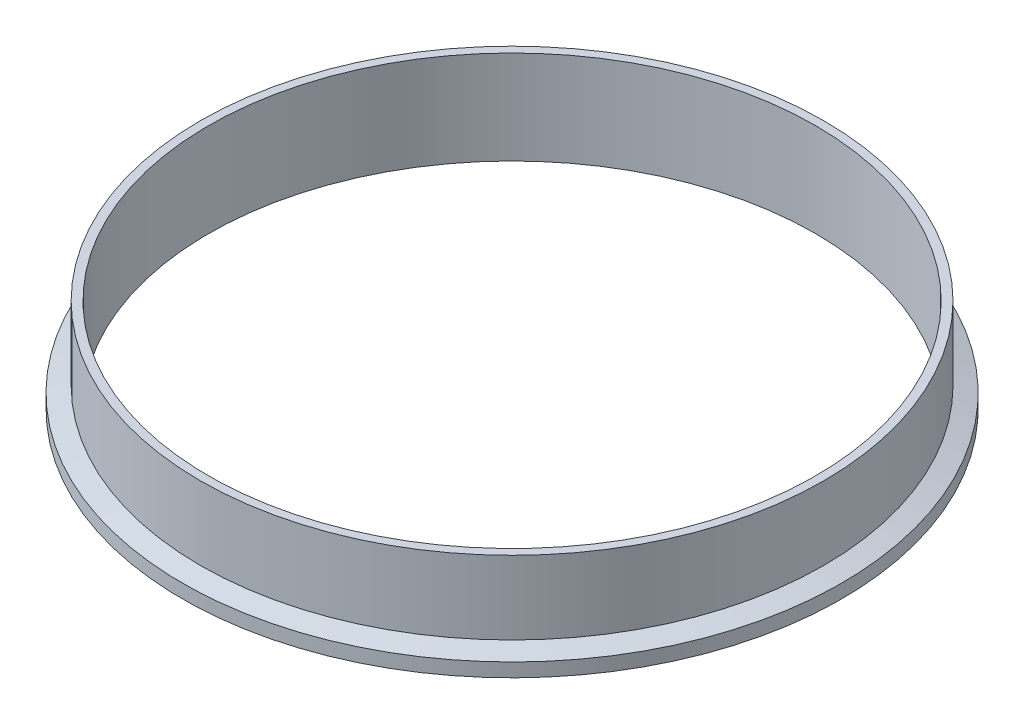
ISO-10303-21;
HEADER;
FILE_DESCRIPTION(('STEP AP214'),'2;1');
FILE_NAME('part.step','',(''),(''),'','','');
FILE_SCHEMA(('AUTOMOTIVE_DESIGN { 1 0 10303 214 1 1 1 1 }'));
ENDSEC;
DATA;
#1=APPLICATION_CONTEXT('core data for automotive mechanical design processes');
#2=APPLICATION_PROTOCOL_DEFINITION('international standard','automotive_design',2000,#1);
#3=PRODUCT_CONTEXT('',#1,'mechanical');
#4=PRODUCT('Part','Part','',(#3));
#5=PRODUCT_RELATED_PRODUCT_CATEGORY('part','',(#4));
#6=PRODUCT_DEFINITION_FORMATION('','',#4);
#7=PRODUCT_DEFINITION_CONTEXT('part definition',#1,'design');
#8=PRODUCT_DEFINITION('design','',#6,#7);
#9=PRODUCT_DEFINITION_SHAPE('','',#8);
#10=(LENGTH_UNIT() NAMED_UNIT(*) SI_UNIT(.MILLI.,.METRE.));
#11=(NAMED_UNIT(*) PLANE_ANGLE_UNIT() SI_UNIT($,.RADIAN.));
#12=(NAMED_UNIT(*) SI_UNIT($,.STERADIAN.) SOLID_ANGLE_UNIT());
#13=UNCERTAINTY_MEASURE_WITH_UNIT(LENGTH_MEASURE(1.E-05),#10,'distance_accuracy_value','');
#14=(GEOMETRIC_REPRESENTATION_CONTEXT(3) GLOBAL_UNCERTAINTY_ASSIGNED_CONTEXT((#13)) GLOBAL_UNIT_ASSIGNED_CONTEXT((#10,
#11,#12)) REPRESENTATION_CONTEXT('',''));
#15=CARTESIAN_POINT('',(0.,0.,0.));
#16=DIRECTION('',(0.,0.,1.));
#17=DIRECTION('',(1.,0.,0.));
#18=AXIS2_PLACEMENT_3D('',#15,#16,#17);
#19=CARTESIAN_POINT('',(0.,0.7874,0.));
#20=DIRECTION('',(0.,-1.,0.));
#21=DIRECTION('',(0.,0.,-1.));
#22=AXIS2_PLACEMENT_3D('',#19,#20,#21);
#23=TOROIDAL_SURFACE('',#22,130.799208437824,0.787400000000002);
#24=CARTESIAN_POINT('',(0.,0.,0.));
#25=DIRECTION('',(0.,-1.,0.));
#26=DIRECTION('',(0.,0.,-1.));
#27=AXIS2_PLACEMENT_3D('',#24,#25,#26);
#28=CIRCLE('',#27,130.799208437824);
#29=CARTESIAN_POINT('',(0.,0.,-130.799208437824));
#30=VERTEX_POINT('',#29);
#31=EDGE_CURVE('E67',#30,#30,#28,.T.);
#32=ORIENTED_EDGE('',*,*,#31,.T.);
#33=EDGE_LOOP('',(#32));
#34=FACE_BOUND('',#33,.T.);
#35=CARTESIAN_POINT('',(0.,0.474458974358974,0.));
#36=DIRECTION('',(0.,-1.,0.));
#37=DIRECTION('',(0.,0.,-1.));
#38=AXIS2_PLACEMENT_3D('',#35,#36,#37);
#39=CIRCLE('',#38,130.076666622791);
#40=CARTESIAN_POINT('',(0.,0.474458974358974,-130.076666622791));
#41=VERTEX_POINT('',#40);
#42=EDGE_CURVE('E10',#41,#41,#39,.T.);
#43=ORIENTED_EDGE('',*,*,#42,.F.);
#44=EDGE_LOOP('',(#43));
#45=FACE_BOUND('',#44,.T.);
#46=ADVANCED_FACE('F33',(#34,#45),#23,.T.);
#47=CARTESIAN_POINT('',(0.,0.,0.));
#48=DIRECTION('',(0.,-1.,0.));
#49=DIRECTION('',(0.,0.,-1.));
#50=AXIS2_PLACEMENT_3D('',#47,#48,#49);
#51=TOROIDAL_SURFACE('',#50,128.9812,1.1938);
#52=CARTESIAN_POINT('',(0.,0.474458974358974,0.));
#53=DIRECTION('',(0.,-1.,0.));
#54=DIRECTION('',(0.,0.,-1.));
#55=AXIS2_PLACEMENT_3D('',#52,#53,#54);
#56=CIRCLE('',#55,127.885733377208);
#57=CARTESIAN_POINT('',(0.,0.474458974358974,-127.885733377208));
#58=VERTEX_POINT('',#57);
#59=EDGE_CURVE('E39',#58,#58,#56,.T.);
#60=ORIENTED_EDGE('',*,*,#59,.F.);
#61=EDGE_LOOP('',(#60));
#62=FACE_BOUND('',#61,.T.);
#63=ORIENTED_EDGE('',*,*,#42,.T.);
#64=EDGE_LOOP('',(#63));
#65=FACE_BOUND('',#64,.T.);
#66=ADVANCED_FACE('F115',(#62,#65),#51,.F.);
#67=CARTESIAN_POINT('',(0.,0.7874,0.));
#68=DIRECTION('',(0.,-1.,0.));
#69=DIRECTION('',(0.,0.,-1.));
#70=AXIS2_PLACEMENT_3D('',#67,#68,#69);
#71=TOROIDAL_SURFACE('',#70,127.163191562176,0.787400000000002);
#72=ORIENTED_EDGE('',*,*,#59,.T.);
#73=EDGE_LOOP('',(#72));
#74=FACE_BOUND('',#73,.T.);
#75=CARTESIAN_POINT('',(0.,0.,0.));
#76=DIRECTION('',(0.,-1.,0.));
#77=DIRECTION('',(0.,0.,-1.));
#78=AXIS2_PLACEMENT_3D('',#75,#76,#77);
#79=CIRCLE('',#78,127.163191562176);
#80=CARTESIAN_POINT('',(0.,0.,-127.163191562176));
#81=VERTEX_POINT('',#80);
#82=EDGE_CURVE('E43',#81,#81,#79,.T.);
#83=ORIENTED_EDGE('',*,*,#82,.F.);
#84=EDGE_LOOP('',(#83));
#85=FACE_BOUND('',#84,.T.);
#86=ADVANCED_FACE('F111',(#74,#85),#71,.T.);
#87=CARTESIAN_POINT('',(0.,0.,0.));
#88=DIRECTION('',(0.,1.,0.));
#89=DIRECTION('',(0.,0.,1.));
#90=AXIS2_PLACEMENT_3D('',#87,#88,#89);
#91=PLANE('',#90);
#92=CARTESIAN_POINT('',(0.,0.,0.));
#93=DIRECTION('',(0.,-1.,0.));
#94=DIRECTION('',(0.,0.,-1.));
#95=AXIS2_PLACEMENT_3D('',#92,#93,#94);
#96=CIRCLE('',#95,123.5964);
#97=CARTESIAN_POINT('',(0.,0.,-123.5964));
#98=VERTEX_POINT('',#97);
#99=EDGE_CURVE('E47',#98,#98,#96,.T.);
#100=ORIENTED_EDGE('',*,*,#99,.F.);
#101=EDGE_LOOP('',(#100));
#102=FACE_BOUND('',#101,.T.);
#103=ORIENTED_EDGE('',*,*,#82,.T.);
#104=EDGE_LOOP('',(#103));
#105=FACE_BOUND('',#104,.T.);
#106=ADVANCED_FACE('F105',(#102,#105),#91,.F.);
#107=CARTESIAN_POINT('',(0.,0.,0.));
#108=DIRECTION('',(0.,-1.,0.));
#109=DIRECTION('',(0.,0.,-1.));
#110=AXIS2_PLACEMENT_3D('',#107,#108,#109);
#111=CYLINDRICAL_SURFACE('',#110,123.5964);
#112=ORIENTED_EDGE('',*,*,#99,.T.);
#113=EDGE_LOOP('',(#112));
#114=FACE_BOUND('',#113,.T.);
#115=CARTESIAN_POINT('',(0.,38.1,0.));
#116=DIRECTION('',(0.,-1.,0.));
#117=DIRECTION('',(0.,0.,-1.));
#118=AXIS2_PLACEMENT_3D('',#115,#116,#117);
#119=CIRCLE('',#118,123.5964);
#120=CARTESIAN_POINT('',(0.,38.1,-123.5964));
#121=VERTEX_POINT('',#120);
#122=EDGE_CURVE('E52',#121,#121,#119,.T.);
#123=ORIENTED_EDGE('',*,*,#122,.F.);
#124=EDGE_LOOP('',(#123));
#125=FACE_BOUND('',#124,.T.);
#126=ADVANCED_FACE('F100',(#114,#125),#111,.F.);
#127=CARTESIAN_POINT('',(0.,38.1,0.));
#128=DIRECTION('',(0.,-1.,0.));
#129=DIRECTION('',(0.,0.,-1.));
#130=AXIS2_PLACEMENT_3D('',#127,#128,#129);
#131=PLANE('',#130);
#132=CARTESIAN_POINT('',(0.,38.1,0.));
#133=DIRECTION('',(0.,-1.,0.));
#134=DIRECTION('',(0.,0.,-1.));
#135=AXIS2_PLACEMENT_3D('',#132,#133,#134);
#136=CIRCLE('',#135,127.);
#137=CARTESIAN_POINT('',(0.,38.1,-127.));
#138=VERTEX_POINT('',#137);
#139=EDGE_CURVE('E55',#138,#138,#136,.T.);
#140=ORIENTED_EDGE('',*,*,#139,.F.);
#141=EDGE_LOOP('',(#140));
#142=FACE_BOUND('',#141,.T.);
#143=ORIENTED_EDGE('',*,*,#122,.T.);
#144=EDGE_LOOP('',(#143));
#145=FACE_BOUND('',#144,.T.);
#146=ADVANCED_FACE('F94',(#142,#145),#131,.F.);
#147=CARTESIAN_POINT('',(0.,0.,0.));
#148=DIRECTION('',(0.,-1.,0.));
#149=DIRECTION('',(0.,0.,-1.));
#150=AXIS2_PLACEMENT_3D('',#147,#148,#149);
#151=CYLINDRICAL_SURFACE('',#150,127.);
#152=CARTESIAN_POINT('',(0.,8.22278052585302,0.));
#153=DIRECTION('',(0.,-1.,0.));
#154=DIRECTION('',(0.,0.,-1.));
#155=AXIS2_PLACEMENT_3D('',#152,#153,#154);
#156=CIRCLE('',#155,127.);
#157=CARTESIAN_POINT('',(0.,8.22278052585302,-127.));
#158=VERTEX_POINT('',#157);
#159=EDGE_CURVE('E58',#158,#158,#156,.T.);
#160=ORIENTED_EDGE('',*,*,#159,.F.);
#161=EDGE_LOOP('',(#160));
#162=FACE_BOUND('',#161,.T.);
#163=ORIENTED_EDGE('',*,*,#139,.T.);
#164=EDGE_LOOP('',(#163));
#165=FACE_BOUND('',#164,.T.);
#166=ADVANCED_FACE('F88',(#162,#165),#151,.T.);
#167=CARTESIAN_POINT('',(0.,8.22278052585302,0.));
#168=DIRECTION('',(0.,-1.,0.));
#169=DIRECTION('',(0.,0.,-1.));
#170=AXIS2_PLACEMENT_3D('',#167,#168,#169);
#171=CONICAL_SURFACE('',#170,127.,1.22173047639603);
#172=CARTESIAN_POINT('',(0.,5.58799999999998,0.));
#173=DIRECTION('',(0.,-1.,0.));
#174=DIRECTION('',(0.,0.,-1.));
#175=AXIS2_PLACEMENT_3D('',#172,#173,#174);
#176=CIRCLE('',#175,134.239);
#177=CARTESIAN_POINT('',(0.,5.58799999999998,-134.239));
#178=VERTEX_POINT('',#177);
#179=EDGE_CURVE('E61',#178,#178,#176,.T.);
#180=ORIENTED_EDGE('',*,*,#179,.F.);
#181=EDGE_LOOP('',(#180));
#182=FACE_BOUND('',#181,.T.);
#183=ORIENTED_EDGE('',*,*,#159,.T.);
#184=EDGE_LOOP('',(#183));
#185=FACE_BOUND('',#184,.T.);
#186=ADVANCED_FACE('F82',(#182,#185),#171,.T.);
#187=CARTESIAN_POINT('',(0.,0.,0.));
#188=DIRECTION('',(0.,-1.,0.));
#189=DIRECTION('',(0.,0.,-1.));
#190=AXIS2_PLACEMENT_3D('',#187,#188,#189);
#191=CYLINDRICAL_SURFACE('',#190,134.239);
#192=CARTESIAN_POINT('',(0.,0.,0.));
#193=DIRECTION('',(0.,-1.,0.));
#194=DIRECTION('',(0.,0.,-1.));
#195=AXIS2_PLACEMENT_3D('',#192,#193,#194);
#196=CIRCLE('',#195,134.239);
#197=CARTESIAN_POINT('',(0.,0.,-134.239));
#198=VERTEX_POINT('',#197);
#199=EDGE_CURVE('E64',#198,#198,#196,.T.);
#200=ORIENTED_EDGE('',*,*,#199,.F.);
#201=EDGE_LOOP('',(#200));
#202=FACE_BOUND('',#201,.T.);
#203=ORIENTED_EDGE('',*,*,#179,.T.);
#204=EDGE_LOOP('',(#203));
#205=FACE_BOUND('',#204,.T.);
#206=ADVANCED_FACE('F76',(#202,#205),#191,.T.);
#207=CARTESIAN_POINT('',(0.,0.,0.));
#208=DIRECTION('',(0.,1.,0.));
#209=DIRECTION('',(0.,0.,1.));
#210=AXIS2_PLACEMENT_3D('',#207,#208,#209);
#211=PLANE('',#210);
#212=ORIENTED_EDGE('',*,*,#31,.F.);
#213=EDGE_LOOP('',(#212));
#214=FACE_BOUND('',#213,.T.);
#215=ORIENTED_EDGE('',*,*,#199,.T.);
#216=EDGE_LOOP('',(#215));
#217=FACE_BOUND('',#216,.T.);
#218=ADVANCED_FACE('F73',(#214,#217),#211,.F.);
#219=CLOSED_SHELL('',(#46,#66,#86,#106,#126,#146,#166,#186,#206,#218));
#220=MANIFOLD_SOLID_BREP('B2',#219);
#221=ADVANCED_BREP_SHAPE_REPRESENTATION('',(#18,#220),#14);
#222=SHAPE_DEFINITION_REPRESENTATION(#9,#221);
ENDSEC;
END-ISO-10303-21;
